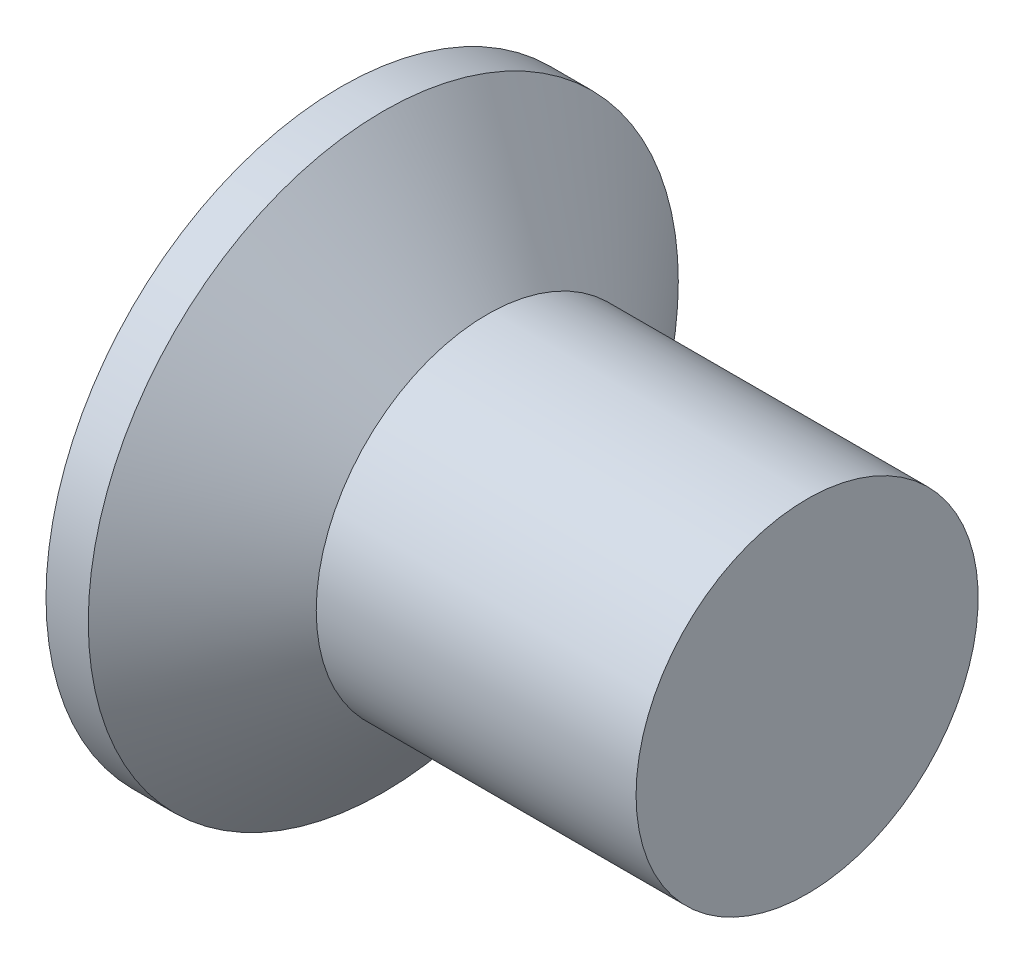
ISO-10303-21;
HEADER;
FILE_DESCRIPTION(('STEP AP214'),'2;1');
FILE_NAME('part.step','',(''),(''),'','','');
FILE_SCHEMA(('AUTOMOTIVE_DESIGN { 1 0 10303 214 1 1 1 1 }'));
ENDSEC;
DATA;
#1=APPLICATION_CONTEXT('core data for automotive mechanical design processes');
#2=APPLICATION_PROTOCOL_DEFINITION('international standard','automotive_design',2000,#1);
#3=PRODUCT_CONTEXT('',#1,'mechanical');
#4=PRODUCT('Part','Part','',(#3));
#5=PRODUCT_RELATED_PRODUCT_CATEGORY('part','',(#4));
#6=PRODUCT_DEFINITION_FORMATION('','',#4);
#7=PRODUCT_DEFINITION_CONTEXT('part definition',#1,'design');
#8=PRODUCT_DEFINITION('design','',#6,#7);
#9=PRODUCT_DEFINITION_SHAPE('','',#8);
#10=(LENGTH_UNIT() NAMED_UNIT(*) SI_UNIT(.MILLI.,.METRE.));
#11=(NAMED_UNIT(*) PLANE_ANGLE_UNIT() SI_UNIT($,.RADIAN.));
#12=(NAMED_UNIT(*) SI_UNIT($,.STERADIAN.) SOLID_ANGLE_UNIT());
#13=UNCERTAINTY_MEASURE_WITH_UNIT(LENGTH_MEASURE(1.E-05),#10,'distance_accuracy_value','');
#14=(GEOMETRIC_REPRESENTATION_CONTEXT(3) GLOBAL_UNCERTAINTY_ASSIGNED_CONTEXT((#13)) GLOBAL_UNIT_ASSIGNED_CONTEXT((#10,
#11,#12)) REPRESENTATION_CONTEXT('',''));
#15=CARTESIAN_POINT('',(0.,0.,0.));
#16=DIRECTION('',(0.,0.,1.));
#17=DIRECTION('',(1.,0.,0.));
#18=AXIS2_PLACEMENT_3D('',#15,#16,#17);
#19=CARTESIAN_POINT('',(0.,0.,0.));
#20=DIRECTION('',(-1.,0.,0.));
#21=DIRECTION('',(0.,0.,1.));
#22=AXIS2_PLACEMENT_3D('',#19,#20,#21);
#23=PLANE('',#22);
#24=CARTESIAN_POINT('',(0.,0.,0.));
#25=DIRECTION('',(-1.,0.,0.));
#26=DIRECTION('',(0.,0.,1.));
#27=AXIS2_PLACEMENT_3D('',#24,#25,#26);
#28=CIRCLE('',#27,3.0226);
#29=CARTESIAN_POINT('',(0.,0.,3.0226));
#30=VERTEX_POINT('',#29);
#31=EDGE_CURVE('E40',#30,#30,#28,.T.);
#32=ORIENTED_EDGE('',*,*,#31,.T.);
#33=EDGE_LOOP('',(#32));
#34=FACE_BOUND('',#33,.T.);
#35=DIRECTION('',(0.,1.,0.));
#36=VECTOR('',#35,1.);
#37=CARTESIAN_POINT('',(0.,-2.0574,-0.419099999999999));
#38=LINE('',#37,#36);
#39=CARTESIAN_POINT('',(0.,-2.0574,-0.419099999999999));
#40=VERTEX_POINT('',#39);
#41=CARTESIAN_POINT('',(0.,-0.419099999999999,-0.419099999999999));
#42=VERTEX_POINT('',#41);
#43=EDGE_CURVE('E101',#40,#42,#38,.T.);
#44=ORIENTED_EDGE('',*,*,#43,.T.);
#45=DIRECTION('',(0.,0.,-1.));
#46=VECTOR('',#45,1.);
#47=CARTESIAN_POINT('',(0.,-0.419100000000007,2.0574));
#48=LINE('',#47,#46);
#49=CARTESIAN_POINT('',(0.,-0.419099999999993,-2.0574));
#50=VERTEX_POINT('',#49);
#51=EDGE_CURVE('E81',#42,#50,#48,.T.);
#52=ORIENTED_EDGE('',*,*,#51,.T.);
#53=DIRECTION('',(0.,1.,0.));
#54=VECTOR('',#53,1.);
#55=CARTESIAN_POINT('',(0.,-0.419099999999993,-2.0574));
#56=LINE('',#55,#54);
#57=CARTESIAN_POINT('',(0.,0.419100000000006,-2.0574));
#58=VERTEX_POINT('',#57);
#59=EDGE_CURVE('E336',#50,#58,#56,.T.);
#60=ORIENTED_EDGE('',*,*,#59,.T.);
#61=DIRECTION('',(0.,0.,1.));
#62=VECTOR('',#61,1.);
#63=CARTESIAN_POINT('',(0.,0.419100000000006,-2.0574));
#64=LINE('',#63,#62);
#65=CARTESIAN_POINT('',(0.,0.419100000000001,-0.419099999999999));
#66=VERTEX_POINT('',#65);
#67=EDGE_CURVE('E97',#58,#66,#64,.T.);
#68=ORIENTED_EDGE('',*,*,#67,.T.);
#69=CARTESIAN_POINT('',(0.,2.0574,-0.419099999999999));
#70=VERTEX_POINT('',#69);
#71=EDGE_CURVE('E91',#66,#70,#38,.T.);
#72=ORIENTED_EDGE('',*,*,#71,.T.);
#73=DIRECTION('',(0.,0.,1.));
#74=VECTOR('',#73,1.);
#75=CARTESIAN_POINT('',(0.,2.0574,-0.419099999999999));
#76=LINE('',#75,#74);
#77=CARTESIAN_POINT('',(0.,2.0574,0.4191));
#78=VERTEX_POINT('',#77);
#79=EDGE_CURVE('E94',#70,#78,#76,.T.);
#80=ORIENTED_EDGE('',*,*,#79,.T.);
#81=DIRECTION('',(0.,-1.,0.));
#82=VECTOR('',#81,1.);
#83=CARTESIAN_POINT('',(0.,2.0574,0.4191));
#84=LINE('',#83,#82);
#85=CARTESIAN_POINT('',(0.,0.419099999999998,0.4191));
#86=VERTEX_POINT('',#85);
#87=EDGE_CURVE('E348',#78,#86,#84,.T.);
#88=ORIENTED_EDGE('',*,*,#87,.T.);
#89=CARTESIAN_POINT('',(0.,0.419099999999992,2.0574));
#90=VERTEX_POINT('',#89);
#91=EDGE_CURVE('E331',#86,#90,#64,.T.);
#92=ORIENTED_EDGE('',*,*,#91,.T.);
#93=DIRECTION('',(0.,-1.,0.));
#94=VECTOR('',#93,1.);
#95=CARTESIAN_POINT('',(0.,0.419099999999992,2.0574));
#96=LINE('',#95,#94);
#97=CARTESIAN_POINT('',(0.,-0.419100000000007,2.0574));
#98=VERTEX_POINT('',#97);
#99=EDGE_CURVE('E317',#90,#98,#96,.T.);
#100=ORIENTED_EDGE('',*,*,#99,.T.);
#101=CARTESIAN_POINT('',(0.,-0.419100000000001,0.4191));
#102=VERTEX_POINT('',#101);
#103=EDGE_CURVE('E329',#98,#102,#48,.T.);
#104=ORIENTED_EDGE('',*,*,#103,.T.);
#105=CARTESIAN_POINT('',(0.,-2.0574,0.4191));
#106=VERTEX_POINT('',#105);
#107=EDGE_CURVE('E107',#102,#106,#84,.T.);
#108=ORIENTED_EDGE('',*,*,#107,.T.);
#109=DIRECTION('',(0.,0.,-1.));
#110=VECTOR('',#109,1.);
#111=CARTESIAN_POINT('',(0.,-2.0574,0.4191));
#112=LINE('',#111,#110);
#113=EDGE_CURVE('E130',#106,#40,#112,.T.);
#114=ORIENTED_EDGE('',*,*,#113,.T.);
#115=EDGE_LOOP('',(#44,#52,#60,#68,#72,#80,#88,#92,#100,#104,#108,#114));
#116=FACE_BOUND('',#115,.T.);
#117=ADVANCED_FACE('F33',(#34,#116),#23,.T.);
#118=CARTESIAN_POINT('',(2.99772371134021,0.,0.185786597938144));
#119=DIRECTION('',(-0.0775955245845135,0.,-0.996984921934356));
#120=DIRECTION('',(-0.996984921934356,0.,0.0775955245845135));
#121=AXIS2_PLACEMENT_3D('',#118,#119,#120);
#122=PLANE('',#121);
#123=ORIENTED_EDGE('',*,*,#107,.F.);
#124=DIRECTION('',(0.99399695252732,0.0773629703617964,-0.0773629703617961));
#125=VECTOR('',#124,1.);
#126=CARTESIAN_POINT('',(3.01201043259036,-0.184674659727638,0.184674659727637));
#127=LINE('',#126,#125);
#128=CARTESIAN_POINT('',(2.6924,-0.209550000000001,0.209549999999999));
#129=VERTEX_POINT('',#128);
#130=EDGE_CURVE('E125',#102,#129,#127,.T.);
#131=ORIENTED_EDGE('',*,*,#130,.T.);
#132=DIRECTION('',(0.822803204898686,0.564706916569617,-0.0640389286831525));
#133=VECTOR('',#132,1.);
#134=CARTESIAN_POINT('',(0.,-2.0574,0.4191));
#135=LINE('',#134,#133);
#136=EDGE_CURVE('E102',#106,#129,#135,.T.);
#137=ORIENTED_EDGE('',*,*,#136,.F.);
#138=EDGE_LOOP('',(#123,#131,#137));
#139=FACE_BOUND('',#138,.T.);
#140=ADVANCED_FACE('F153',(#139),#122,.T.);
#141=DIRECTION('',(0.822803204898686,-0.564706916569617,-0.0640389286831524));
#142=VECTOR('',#141,1.);
#143=CARTESIAN_POINT('',(0.,2.0574,0.4191));
#144=LINE('',#143,#142);
#145=CARTESIAN_POINT('',(2.6924,0.20955,0.20955));
#146=VERTEX_POINT('',#145);
#147=EDGE_CURVE('E47',#78,#146,#144,.T.);
#148=ORIENTED_EDGE('',*,*,#147,.T.);
#149=DIRECTION('',(-0.99399695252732,0.0773629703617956,0.0773629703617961));
#150=VECTOR('',#149,1.);
#151=CARTESIAN_POINT('',(3.01201043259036,0.184674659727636,0.184674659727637));
#152=LINE('',#151,#150);
#153=EDGE_CURVE('E344',#146,#86,#152,.T.);
#154=ORIENTED_EDGE('',*,*,#153,.T.);
#155=ORIENTED_EDGE('',*,*,#87,.F.);
#156=EDGE_LOOP('',(#148,#154,#155));
#157=FACE_BOUND('',#156,.T.);
#158=ADVANCED_FACE('F157',(#157),#122,.T.);
#159=CARTESIAN_POINT('',(2.99772371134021,0.,-0.185786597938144));
#160=DIRECTION('',(-0.0775955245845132,0.,0.996984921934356));
#161=DIRECTION('',(0.996984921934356,0.,0.0775955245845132));
#162=AXIS2_PLACEMENT_3D('',#159,#160,#161);
#163=PLANE('',#162);
#164=DIRECTION('',(0.822803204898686,0.564706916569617,0.0640389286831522));
#165=VECTOR('',#164,1.);
#166=CARTESIAN_POINT('',(0.,-2.0574,-0.419099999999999));
#167=LINE('',#166,#165);
#168=CARTESIAN_POINT('',(2.6924,-0.209549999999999,-0.209550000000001));
#169=VERTEX_POINT('',#168);
#170=EDGE_CURVE('E56',#40,#169,#167,.T.);
#171=ORIENTED_EDGE('',*,*,#170,.T.);
#172=DIRECTION('',(-0.99399695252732,-0.0773629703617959,-0.0773629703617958));
#173=VECTOR('',#172,1.);
#174=CARTESIAN_POINT('',(3.01201043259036,-0.184674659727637,-0.184674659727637));
#175=LINE('',#174,#173);
#176=EDGE_CURVE('E11',#169,#42,#175,.T.);
#177=ORIENTED_EDGE('',*,*,#176,.T.);
#178=ORIENTED_EDGE('',*,*,#43,.F.);
#179=EDGE_LOOP('',(#171,#177,#178));
#180=FACE_BOUND('',#179,.T.);
#181=ADVANCED_FACE('F150',(#180),#163,.T.);
#182=ORIENTED_EDGE('',*,*,#71,.F.);
#183=DIRECTION('',(0.99399695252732,-0.0773629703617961,0.0773629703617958));
#184=VECTOR('',#183,1.);
#185=CARTESIAN_POINT('',(3.01201043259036,0.184674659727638,-0.184674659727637));
#186=LINE('',#185,#184);
#187=CARTESIAN_POINT('',(2.6924,0.20955,-0.20955));
#188=VERTEX_POINT('',#187);
#189=EDGE_CURVE('E110',#66,#188,#186,.T.);
#190=ORIENTED_EDGE('',*,*,#189,.T.);
#191=DIRECTION('',(0.822803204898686,-0.564706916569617,0.0640389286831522));
#192=VECTOR('',#191,1.);
#193=CARTESIAN_POINT('',(0.,2.0574,-0.419099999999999));
#194=LINE('',#193,#192);
#195=EDGE_CURVE('E106',#70,#188,#194,.T.);
#196=ORIENTED_EDGE('',*,*,#195,.F.);
#197=EDGE_LOOP('',(#182,#190,#196));
#198=FACE_BOUND('',#197,.T.);
#199=ADVANCED_FACE('F109',(#198),#163,.T.);
#200=CARTESIAN_POINT('',(-6.34999999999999,0.,0.));
#201=DIRECTION('',(-1.,0.,0.));
#202=DIRECTION('',(0.,0.,1.));
#203=AXIS2_PLACEMENT_3D('',#200,#201,#202);
#204=CYLINDRICAL_SURFACE('',#203,3.0226);
#205=CARTESIAN_POINT('',(0.432943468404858,0.,0.));
#206=DIRECTION('',(-1.,0.,0.));
#207=DIRECTION('',(0.,0.,1.));
#208=AXIS2_PLACEMENT_3D('',#205,#206,#207);
#209=CIRCLE('',#208,3.0226);
#210=CARTESIAN_POINT('',(0.432943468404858,0.,3.0226));
#211=VERTEX_POINT('',#210);
#212=EDGE_CURVE('E133',#211,#211,#209,.T.);
#213=ORIENTED_EDGE('',*,*,#212,.T.);
#214=EDGE_LOOP('',(#213));
#215=FACE_BOUND('',#214,.T.);
#216=ORIENTED_EDGE('',*,*,#31,.F.);
#217=EDGE_LOOP('',(#216));
#218=FACE_BOUND('',#217,.T.);
#219=ADVANCED_FACE('F139',(#215,#218),#204,.T.);
#220=CARTESIAN_POINT('',(0.432943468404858,0.,0.));
#221=DIRECTION('',(-1.,0.,0.));
#222=DIRECTION('',(0.,0.,1.));
#223=AXIS2_PLACEMENT_3D('',#220,#221,#222);
#224=CONICAL_SURFACE('',#223,3.0226,0.872664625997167);
#225=CARTESIAN_POINT('',(1.4986,0.,0.));
#226=DIRECTION('',(-1.,0.,0.));
#227=DIRECTION('',(0.,0.,1.));
#228=AXIS2_PLACEMENT_3D('',#225,#226,#227);
#229=CIRCLE('',#228,1.7526);
#230=CARTESIAN_POINT('',(1.4986,0.,1.7526));
#231=VERTEX_POINT('',#230);
#232=EDGE_CURVE('E129',#231,#231,#229,.T.);
#233=ORIENTED_EDGE('',*,*,#232,.T.);
#234=EDGE_LOOP('',(#233));
#235=FACE_BOUND('',#234,.T.);
#236=ORIENTED_EDGE('',*,*,#212,.F.);
#237=EDGE_LOOP('',(#236));
#238=FACE_BOUND('',#237,.T.);
#239=ADVANCED_FACE('F141',(#235,#238),#224,.T.);
#240=CARTESIAN_POINT('',(-6.34999999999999,0.,0.));
#241=DIRECTION('',(-1.,0.,0.));
#242=DIRECTION('',(0.,0.,1.));
#243=AXIS2_PLACEMENT_3D('',#240,#241,#242);
#244=CYLINDRICAL_SURFACE('',#243,1.7526);
#245=CARTESIAN_POINT('',(4.7752,0.,0.));
#246=DIRECTION('',(-1.,0.,0.));
#247=DIRECTION('',(0.,0.,1.));
#248=AXIS2_PLACEMENT_3D('',#245,#246,#247);
#249=CIRCLE('',#248,1.7526);
#250=CARTESIAN_POINT('',(4.7752,0.,1.7526));
#251=VERTEX_POINT('',#250);
#252=EDGE_CURVE('E126',#251,#251,#249,.T.);
#253=ORIENTED_EDGE('',*,*,#252,.T.);
#254=EDGE_LOOP('',(#253));
#255=FACE_BOUND('',#254,.T.);
#256=ORIENTED_EDGE('',*,*,#232,.F.);
#257=EDGE_LOOP('',(#256));
#258=FACE_BOUND('',#257,.T.);
#259=ADVANCED_FACE('F147',(#255,#258),#244,.T.);
#260=CARTESIAN_POINT('',(4.7752,1.7526,0.));
#261=DIRECTION('',(1.,0.,0.));
#262=DIRECTION('',(0.,0.,-1.));
#263=AXIS2_PLACEMENT_3D('',#260,#261,#262);
#264=PLANE('',#263);
#265=ORIENTED_EDGE('',*,*,#252,.F.);
#266=EDGE_LOOP('',(#265));
#267=FACE_BOUND('',#266,.T.);
#268=ADVANCED_FACE('F177',(#267),#264,.T.);
#269=CARTESIAN_POINT('',(2.6924,0.20955,-0.20955));
#270=DIRECTION('',(1.,0.,0.));
#271=DIRECTION('',(0.,0.,-1.));
#272=AXIS2_PLACEMENT_3D('',#269,#270,#271);
#273=PLANE('',#272);
#274=DIRECTION('',(0.,1.,0.));
#275=VECTOR('',#274,1.);
#276=CARTESIAN_POINT('',(2.6924,-0.20955,-0.20955));
#277=LINE('',#276,#275);
#278=EDGE_CURVE('E121',#169,#188,#277,.T.);
#279=ORIENTED_EDGE('',*,*,#278,.F.);
#280=DIRECTION('',(0.,0.,-1.));
#281=VECTOR('',#280,1.);
#282=CARTESIAN_POINT('',(2.6924,-0.20955,0.20955));
#283=LINE('',#282,#281);
#284=EDGE_CURVE('E112',#129,#169,#283,.T.);
#285=ORIENTED_EDGE('',*,*,#284,.F.);
#286=DIRECTION('',(0.,-1.,0.));
#287=VECTOR('',#286,1.);
#288=CARTESIAN_POINT('',(2.6924,0.20955,0.20955));
#289=LINE('',#288,#287);
#290=EDGE_CURVE('E115',#146,#129,#289,.T.);
#291=ORIENTED_EDGE('',*,*,#290,.F.);
#292=DIRECTION('',(0.,0.,1.));
#293=VECTOR('',#292,1.);
#294=CARTESIAN_POINT('',(2.6924,0.20955,-0.20955));
#295=LINE('',#294,#293);
#296=EDGE_CURVE('E119',#188,#146,#295,.T.);
#297=ORIENTED_EDGE('',*,*,#296,.F.);
#298=EDGE_LOOP('',(#279,#285,#291,#297));
#299=FACE_BOUND('',#298,.T.);
#300=ADVANCED_FACE('F174',(#299),#273,.F.);
#301=CARTESIAN_POINT('',(2.6924,-0.20955,-0.20955));
#302=DIRECTION('',(-0.56586841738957,0.82449556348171,0.));
#303=DIRECTION('',(-0.82449556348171,-0.56586841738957,0.));
#304=AXIS2_PLACEMENT_3D('',#301,#302,#303);
#305=PLANE('',#304);
#306=ORIENTED_EDGE('',*,*,#170,.F.);
#307=ORIENTED_EDGE('',*,*,#113,.F.);
#308=ORIENTED_EDGE('',*,*,#136,.T.);
#309=ORIENTED_EDGE('',*,*,#284,.T.);
#310=EDGE_LOOP('',(#306,#307,#308,#309));
#311=FACE_BOUND('',#310,.T.);
#312=ADVANCED_FACE('F166',(#311),#305,.T.);
#313=CARTESIAN_POINT('',(2.6924,0.20955,0.20955));
#314=DIRECTION('',(-0.56586841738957,-0.82449556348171,0.));
#315=DIRECTION('',(0.82449556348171,-0.56586841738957,0.));
#316=AXIS2_PLACEMENT_3D('',#313,#314,#315);
#317=PLANE('',#316);
#318=ORIENTED_EDGE('',*,*,#147,.F.);
#319=ORIENTED_EDGE('',*,*,#79,.F.);
#320=ORIENTED_EDGE('',*,*,#195,.T.);
#321=ORIENTED_EDGE('',*,*,#296,.T.);
#322=EDGE_LOOP('',(#318,#319,#320,#321));
#323=FACE_BOUND('',#322,.T.);
#324=ADVANCED_FACE('F105',(#323),#317,.T.);
#325=CARTESIAN_POINT('',(2.99772371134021,-0.185786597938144,0.));
#326=DIRECTION('',(-0.0775955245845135,0.996984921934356,0.));
#327=DIRECTION('',(-0.996984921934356,-0.0775955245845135,0.));
#328=AXIS2_PLACEMENT_3D('',#325,#326,#327);
#329=PLANE('',#328);
#330=DIRECTION('',(0.822803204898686,0.0640389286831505,0.564706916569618));
#331=VECTOR('',#330,1.);
#332=CARTESIAN_POINT('',(0.,-0.419099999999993,-2.0574));
#333=LINE('',#332,#331);
#334=EDGE_CURVE('E338',#50,#169,#333,.T.);
#335=ORIENTED_EDGE('',*,*,#334,.F.);
#336=ORIENTED_EDGE('',*,*,#51,.F.);
#337=ORIENTED_EDGE('',*,*,#176,.F.);
#338=EDGE_LOOP('',(#335,#336,#337));
#339=FACE_BOUND('',#338,.T.);
#340=ADVANCED_FACE('F173',(#339),#329,.T.);
#341=CARTESIAN_POINT('',(2.99772371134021,0.185786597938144,0.));
#342=DIRECTION('',(-0.0775955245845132,-0.996984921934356,0.));
#343=DIRECTION('',(0.996984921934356,-0.0775955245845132,0.));
#344=AXIS2_PLACEMENT_3D('',#341,#342,#343);
#345=PLANE('',#344);
#346=ORIENTED_EDGE('',*,*,#67,.F.);
#347=DIRECTION('',(0.822803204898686,-0.0640389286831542,0.564706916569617));
#348=VECTOR('',#347,1.);
#349=CARTESIAN_POINT('',(0.,0.419100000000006,-2.0574));
#350=LINE('',#349,#348);
#351=EDGE_CURVE('E72',#58,#188,#350,.T.);
#352=ORIENTED_EDGE('',*,*,#351,.T.);
#353=ORIENTED_EDGE('',*,*,#189,.F.);
#354=EDGE_LOOP('',(#346,#352,#353));
#355=FACE_BOUND('',#354,.T.);
#356=ADVANCED_FACE('F217',(#355),#345,.T.);
#357=CARTESIAN_POINT('',(2.6924,0.209550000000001,-0.209549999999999));
#358=DIRECTION('',(-0.56586841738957,0.,0.82449556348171));
#359=DIRECTION('',(-0.82449556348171,0.,-0.56586841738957));
#360=AXIS2_PLACEMENT_3D('',#357,#358,#359);
#361=PLANE('',#360);
#362=ORIENTED_EDGE('',*,*,#351,.F.);
#363=ORIENTED_EDGE('',*,*,#59,.F.);
#364=ORIENTED_EDGE('',*,*,#334,.T.);
#365=ORIENTED_EDGE('',*,*,#278,.T.);
#366=EDGE_LOOP('',(#362,#363,#364,#365));
#367=FACE_BOUND('',#366,.T.);
#368=ADVANCED_FACE('F225',(#367),#361,.T.);
#369=ORIENTED_EDGE('',*,*,#103,.F.);
#370=DIRECTION('',(0.822803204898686,0.0640389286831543,-0.564706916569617));
#371=VECTOR('',#370,1.);
#372=CARTESIAN_POINT('',(0.,-0.419100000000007,2.0574));
#373=LINE('',#372,#371);
#374=EDGE_CURVE('E314',#98,#129,#373,.T.);
#375=ORIENTED_EDGE('',*,*,#374,.T.);
#376=ORIENTED_EDGE('',*,*,#130,.F.);
#377=EDGE_LOOP('',(#369,#375,#376));
#378=FACE_BOUND('',#377,.T.);
#379=ADVANCED_FACE('F219',(#378),#329,.T.);
#380=DIRECTION('',(0.822803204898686,-0.0640389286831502,-0.564706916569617));
#381=VECTOR('',#380,1.);
#382=CARTESIAN_POINT('',(0.,0.419099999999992,2.0574));
#383=LINE('',#382,#381);
#384=EDGE_CURVE('E325',#90,#146,#383,.T.);
#385=ORIENTED_EDGE('',*,*,#384,.F.);
#386=ORIENTED_EDGE('',*,*,#91,.F.);
#387=ORIENTED_EDGE('',*,*,#153,.F.);
#388=EDGE_LOOP('',(#385,#386,#387));
#389=FACE_BOUND('',#388,.T.);
#390=ADVANCED_FACE('F227',(#389),#345,.T.);
#391=CARTESIAN_POINT('',(2.6924,-0.209550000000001,0.209549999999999));
#392=DIRECTION('',(-0.56586841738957,0.,-0.82449556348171));
#393=DIRECTION('',(0.82449556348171,0.,-0.56586841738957));
#394=AXIS2_PLACEMENT_3D('',#391,#392,#393);
#395=PLANE('',#394);
#396=ORIENTED_EDGE('',*,*,#374,.F.);
#397=ORIENTED_EDGE('',*,*,#99,.F.);
#398=ORIENTED_EDGE('',*,*,#384,.T.);
#399=ORIENTED_EDGE('',*,*,#290,.T.);
#400=EDGE_LOOP('',(#396,#397,#398,#399));
#401=FACE_BOUND('',#400,.T.);
#402=ADVANCED_FACE('F246',(#401),#395,.T.);
#403=CLOSED_SHELL('',(#117,#140,#158,#181,#199,#219,#239,#259,#268,#300,#312,#324,#340,#356,
#368,#379,#390,#402));
#404=MANIFOLD_SOLID_BREP('B2',#403);
#405=ADVANCED_BREP_SHAPE_REPRESENTATION('',(#18,#404),#14);
#406=SHAPE_DEFINITION_REPRESENTATION(#9,#405);
ENDSEC;
END-ISO-10303-21;
